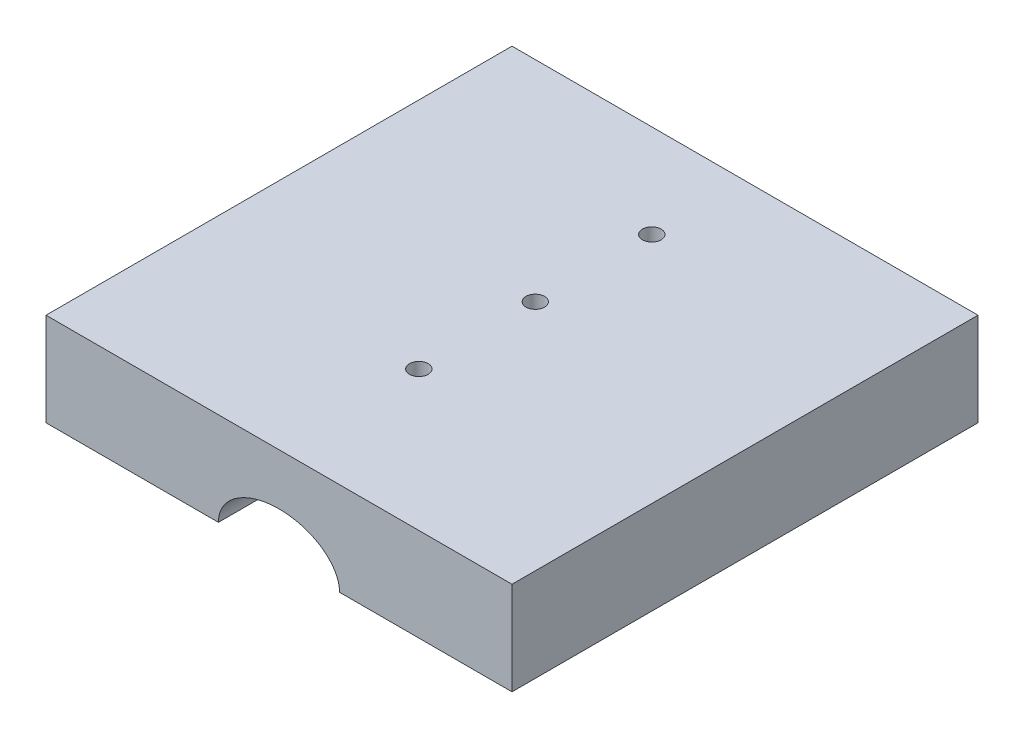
from build123d import *

# Parameters (mm, degrees)
EXTRUDE_1_DEPTH        = 100
SKETCH_2_R             = 2
CUT_EXTRUDE_1_DEPTH    = 114.578167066
PATTERN_LINEAR_1_COUNT = 3
PATTERN_LINEAR_1_PITCH = 25


with BuildPart() as part:
    # Sketch 1 → Extrude 1 (new body)
    with BuildSketch(Plane.XY):
        with BuildLine():
            Line((-13, 0), (-50, 0))
            Line((-50, 0), (-50, 20))
            Line((-50, 20), (50, 20))
            Line((50, 20), (50, 0))
            Line((50, 0), (13, 0))
            add(Edge.make_bspline(
                [(13, 0), (13, 9), (0, 9), (-13, 9), (-13, 0)],
                knots=[3.141592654, 3.141592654, 3.141592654, 4.71238898, 4.71238898, 6.283185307, 6.283185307, 6.283185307], degree=2, weights=[1, 0.707106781, 1, 0.707106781, 1]))
        make_face()
    extrude(amount=EXTRUDE_1_DEPTH)

    # Sketch 2 → Cut-Extrude 1 (cut, through all)
    with BuildSketch(Plane(origin=(0, 20, 0), x_dir=(1, 0, 0), z_dir=(0, 1, 0))):
        with Locations(Location((0, -20, 0), (0, 0, 180))):
            Circle(SKETCH_2_R)
    cut_extrude_1 = extrude(amount=-CUT_EXTRUDE_1_DEPTH, mode=Mode.SUBTRACT)

    # Pattern Linear 1: Cut-Extrude 1 ×3
    with Locations(*[(0, 0, i * PATTERN_LINEAR_1_PITCH) for i in range(1, PATTERN_LINEAR_1_COUNT)]):
        add(cut_extrude_1, mode=Mode.SUBTRACT)


solid = part.part
